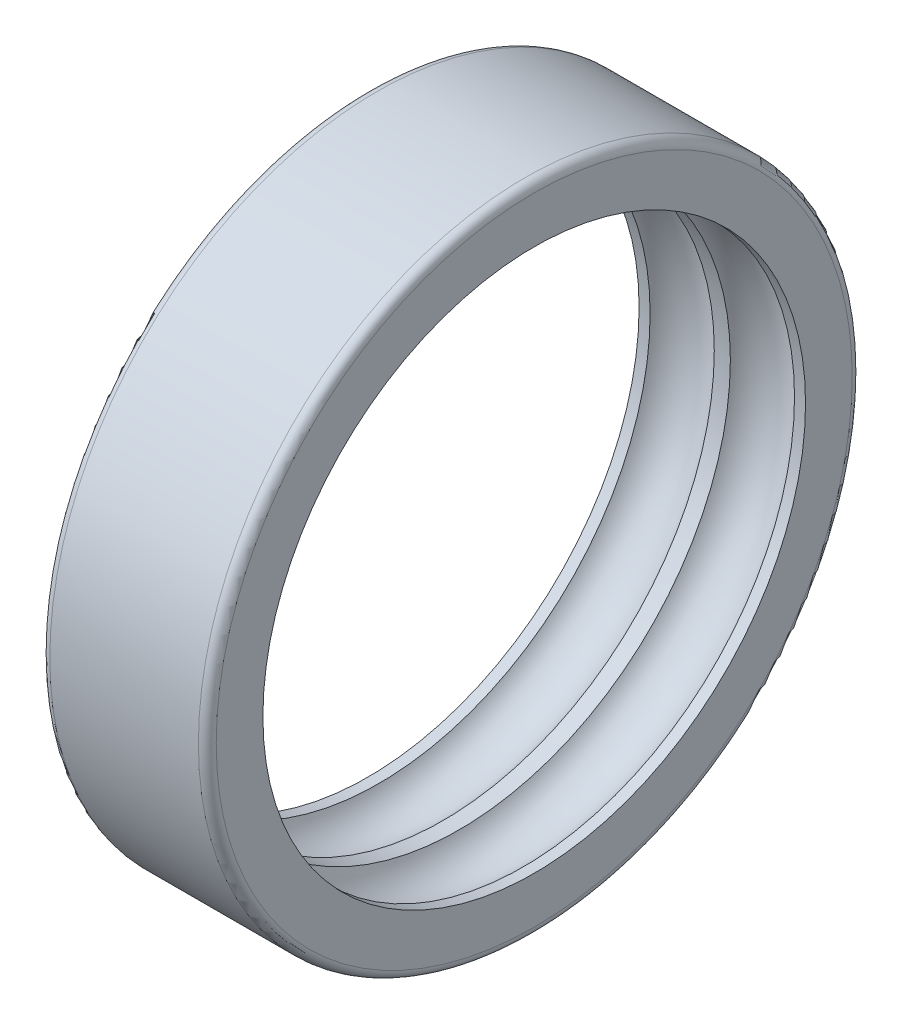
ISO-10303-21;
HEADER;
FILE_DESCRIPTION(('STEP AP214'),'2;1');
FILE_NAME('part.step','',(''),(''),'','','');
FILE_SCHEMA(('AUTOMOTIVE_DESIGN { 1 0 10303 214 1 1 1 1 }'));
ENDSEC;
DATA;
#1=APPLICATION_CONTEXT('core data for automotive mechanical design processes');
#2=APPLICATION_PROTOCOL_DEFINITION('international standard','automotive_design',2000,#1);
#3=PRODUCT_CONTEXT('',#1,'mechanical');
#4=PRODUCT('Part','Part','',(#3));
#5=PRODUCT_RELATED_PRODUCT_CATEGORY('part','',(#4));
#6=PRODUCT_DEFINITION_FORMATION('','',#4);
#7=PRODUCT_DEFINITION_CONTEXT('part definition',#1,'design');
#8=PRODUCT_DEFINITION('design','',#6,#7);
#9=PRODUCT_DEFINITION_SHAPE('','',#8);
#10=(LENGTH_UNIT() NAMED_UNIT(*) SI_UNIT(.MILLI.,.METRE.));
#11=(NAMED_UNIT(*) PLANE_ANGLE_UNIT() SI_UNIT($,.RADIAN.));
#12=(NAMED_UNIT(*) SI_UNIT($,.STERADIAN.) SOLID_ANGLE_UNIT());
#13=UNCERTAINTY_MEASURE_WITH_UNIT(LENGTH_MEASURE(1.E-05),#10,'distance_accuracy_value','');
#14=(GEOMETRIC_REPRESENTATION_CONTEXT(3) GLOBAL_UNCERTAINTY_ASSIGNED_CONTEXT((#13)) GLOBAL_UNIT_ASSIGNED_CONTEXT((#10,
#11,#12)) REPRESENTATION_CONTEXT('',''));
#15=CARTESIAN_POINT('',(0.,0.,0.));
#16=DIRECTION('',(0.,0.,1.));
#17=DIRECTION('',(1.,0.,0.));
#18=AXIS2_PLACEMENT_3D('',#15,#16,#17);
#19=CARTESIAN_POINT('',(1.5,0.,0.));
#20=DIRECTION('',(-1.,0.,0.));
#21=DIRECTION('',(0.,0.,1.));
#22=AXIS2_PLACEMENT_3D('',#19,#20,#21);
#23=TOROIDAL_SURFACE('',#22,53.5,1.5);
#24=CARTESIAN_POINT('',(0.,0.,0.));
#25=DIRECTION('',(-1.,0.,0.));
#26=DIRECTION('',(0.,0.,1.));
#27=AXIS2_PLACEMENT_3D('',#24,#25,#26);
#28=CIRCLE('',#27,53.5);
#29=CARTESIAN_POINT('',(0.,0.,53.5));
#30=VERTEX_POINT('',#29);
#31=EDGE_CURVE('E10',#30,#30,#28,.T.);
#32=ORIENTED_EDGE('',*,*,#31,.F.);
#33=EDGE_LOOP('',(#32));
#34=FACE_BOUND('',#33,.T.);
#35=CARTESIAN_POINT('',(1.5,0.,0.));
#36=DIRECTION('',(-1.,0.,0.));
#37=DIRECTION('',(0.,0.,1.));
#38=AXIS2_PLACEMENT_3D('',#35,#36,#37);
#39=CIRCLE('',#38,55.);
#40=CARTESIAN_POINT('',(1.5,0.,55.));
#41=VERTEX_POINT('',#40);
#42=EDGE_CURVE('E62',#41,#41,#39,.T.);
#43=ORIENTED_EDGE('',*,*,#42,.T.);
#44=EDGE_LOOP('',(#43));
#45=FACE_BOUND('',#44,.T.);
#46=ADVANCED_FACE('F28',(#34,#45),#23,.T.);
#47=CARTESIAN_POINT('',(0.,0.,-53.5));
#48=DIRECTION('',(1.,0.,0.));
#49=DIRECTION('',(0.,0.,-1.));
#50=AXIS2_PLACEMENT_3D('',#47,#48,#49);
#51=PLANE('',#50);
#52=CARTESIAN_POINT('',(0.,0.,0.));
#53=DIRECTION('',(-1.,0.,0.));
#54=DIRECTION('',(0.,0.,1.));
#55=AXIS2_PLACEMENT_3D('',#52,#53,#54);
#56=CIRCLE('',#55,45.65);
#57=CARTESIAN_POINT('',(0.,0.,45.65));
#58=VERTEX_POINT('',#57);
#59=EDGE_CURVE('E34',#58,#58,#56,.T.);
#60=ORIENTED_EDGE('',*,*,#59,.F.);
#61=EDGE_LOOP('',(#60));
#62=FACE_BOUND('',#61,.T.);
#63=ORIENTED_EDGE('',*,*,#31,.T.);
#64=EDGE_LOOP('',(#63));
#65=FACE_BOUND('',#64,.T.);
#66=ADVANCED_FACE('F111',(#62,#65),#51,.F.);
#67=CARTESIAN_POINT('',(0.,0.,0.));
#68=DIRECTION('',(-1.,0.,0.));
#69=DIRECTION('',(0.,0.,1.));
#70=AXIS2_PLACEMENT_3D('',#67,#68,#69);
#71=CYLINDRICAL_SURFACE('',#70,45.65);
#72=CARTESIAN_POINT('',(1.85185216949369,0.,0.));
#73=DIRECTION('',(-1.,0.,0.));
#74=DIRECTION('',(0.,0.,1.));
#75=AXIS2_PLACEMENT_3D('',#72,#73,#74);
#76=CIRCLE('',#75,45.65);
#77=CARTESIAN_POINT('',(1.85185216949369,0.,45.65));
#78=VERTEX_POINT('',#77);
#79=EDGE_CURVE('E38',#78,#78,#76,.T.);
#80=ORIENTED_EDGE('',*,*,#79,.F.);
#81=EDGE_LOOP('',(#80));
#82=FACE_BOUND('',#81,.T.);
#83=ORIENTED_EDGE('',*,*,#59,.T.);
#84=EDGE_LOOP('',(#83));
#85=FACE_BOUND('',#84,.T.);
#86=ADVANCED_FACE('F106',(#82,#85),#71,.F.);
#87=CARTESIAN_POINT('',(7.25,0.,0.));
#88=DIRECTION('',(-1.,0.,0.));
#89=DIRECTION('',(0.,0.,1.));
#90=AXIS2_PLACEMENT_3D('',#87,#88,#89);
#91=TOROIDAL_SURFACE('',#90,42.5,6.25);
#92=CARTESIAN_POINT('',(12.6481478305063,0.,0.));
#93=DIRECTION('',(-1.,0.,0.));
#94=DIRECTION('',(0.,0.,1.));
#95=AXIS2_PLACEMENT_3D('',#92,#93,#94);
#96=CIRCLE('',#95,45.65);
#97=CARTESIAN_POINT('',(12.6481478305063,0.,45.65));
#98=VERTEX_POINT('',#97);
#99=EDGE_CURVE('E42',#98,#98,#96,.T.);
#100=ORIENTED_EDGE('',*,*,#99,.F.);
#101=EDGE_LOOP('',(#100));
#102=FACE_BOUND('',#101,.T.);
#103=ORIENTED_EDGE('',*,*,#79,.T.);
#104=EDGE_LOOP('',(#103));
#105=FACE_BOUND('',#104,.T.);
#106=ADVANCED_FACE('F100',(#102,#105),#91,.F.);
#107=CARTESIAN_POINT('',(0.,0.,0.));
#108=DIRECTION('',(-1.,0.,0.));
#109=DIRECTION('',(0.,0.,1.));
#110=AXIS2_PLACEMENT_3D('',#107,#108,#109);
#111=CYLINDRICAL_SURFACE('',#110,45.65);
#112=CARTESIAN_POINT('',(15.3518521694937,0.,0.));
#113=DIRECTION('',(-1.,0.,0.));
#114=DIRECTION('',(0.,0.,1.));
#115=AXIS2_PLACEMENT_3D('',#112,#113,#114);
#116=CIRCLE('',#115,45.65);
#117=CARTESIAN_POINT('',(15.3518521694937,0.,45.65));
#118=VERTEX_POINT('',#117);
#119=EDGE_CURVE('E47',#118,#118,#116,.T.);
#120=ORIENTED_EDGE('',*,*,#119,.F.);
#121=EDGE_LOOP('',(#120));
#122=FACE_BOUND('',#121,.T.);
#123=ORIENTED_EDGE('',*,*,#99,.T.);
#124=EDGE_LOOP('',(#123));
#125=FACE_BOUND('',#124,.T.);
#126=ADVANCED_FACE('F94',(#122,#125),#111,.F.);
#127=CARTESIAN_POINT('',(20.75,0.,0.));
#128=DIRECTION('',(-1.,0.,0.));
#129=DIRECTION('',(0.,0.,1.));
#130=AXIS2_PLACEMENT_3D('',#127,#128,#129);
#131=TOROIDAL_SURFACE('',#130,42.5,6.25);
#132=CARTESIAN_POINT('',(26.1481478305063,0.,0.));
#133=DIRECTION('',(-1.,0.,0.));
#134=DIRECTION('',(0.,0.,1.));
#135=AXIS2_PLACEMENT_3D('',#132,#133,#134);
#136=CIRCLE('',#135,45.65);
#137=CARTESIAN_POINT('',(26.1481478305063,0.,45.65));
#138=VERTEX_POINT('',#137);
#139=EDGE_CURVE('E50',#138,#138,#136,.T.);
#140=ORIENTED_EDGE('',*,*,#139,.F.);
#141=EDGE_LOOP('',(#140));
#142=FACE_BOUND('',#141,.T.);
#143=ORIENTED_EDGE('',*,*,#119,.T.);
#144=EDGE_LOOP('',(#143));
#145=FACE_BOUND('',#144,.T.);
#146=ADVANCED_FACE('F88',(#142,#145),#131,.F.);
#147=CARTESIAN_POINT('',(0.,0.,0.));
#148=DIRECTION('',(-1.,0.,0.));
#149=DIRECTION('',(0.,0.,1.));
#150=AXIS2_PLACEMENT_3D('',#147,#148,#149);
#151=CYLINDRICAL_SURFACE('',#150,45.65);
#152=CARTESIAN_POINT('',(28.,0.,0.));
#153=DIRECTION('',(-1.,0.,0.));
#154=DIRECTION('',(0.,0.,1.));
#155=AXIS2_PLACEMENT_3D('',#152,#153,#154);
#156=CIRCLE('',#155,45.65);
#157=CARTESIAN_POINT('',(28.,0.,45.65));
#158=VERTEX_POINT('',#157);
#159=EDGE_CURVE('E53',#158,#158,#156,.T.);
#160=ORIENTED_EDGE('',*,*,#159,.F.);
#161=EDGE_LOOP('',(#160));
#162=FACE_BOUND('',#161,.T.);
#163=ORIENTED_EDGE('',*,*,#139,.T.);
#164=EDGE_LOOP('',(#163));
#165=FACE_BOUND('',#164,.T.);
#166=ADVANCED_FACE('F82',(#162,#165),#151,.F.);
#167=CARTESIAN_POINT('',(28.,0.,-53.5));
#168=DIRECTION('',(-1.,0.,0.));
#169=DIRECTION('',(0.,0.,1.));
#170=AXIS2_PLACEMENT_3D('',#167,#168,#169);
#171=PLANE('',#170);
#172=CARTESIAN_POINT('',(28.,0.,0.));
#173=DIRECTION('',(-1.,0.,0.));
#174=DIRECTION('',(0.,0.,1.));
#175=AXIS2_PLACEMENT_3D('',#172,#173,#174);
#176=CIRCLE('',#175,53.5);
#177=CARTESIAN_POINT('',(28.,0.,53.5));
#178=VERTEX_POINT('',#177);
#179=EDGE_CURVE('E56',#178,#178,#176,.T.);
#180=ORIENTED_EDGE('',*,*,#179,.F.);
#181=EDGE_LOOP('',(#180));
#182=FACE_BOUND('',#181,.T.);
#183=ORIENTED_EDGE('',*,*,#159,.T.);
#184=EDGE_LOOP('',(#183));
#185=FACE_BOUND('',#184,.T.);
#186=ADVANCED_FACE('F76',(#182,#185),#171,.F.);
#187=CARTESIAN_POINT('',(26.5,0.,0.));
#188=DIRECTION('',(-1.,0.,0.));
#189=DIRECTION('',(0.,0.,1.));
#190=AXIS2_PLACEMENT_3D('',#187,#188,#189);
#191=TOROIDAL_SURFACE('',#190,53.5,1.5);
#192=CARTESIAN_POINT('',(26.5,0.,0.));
#193=DIRECTION('',(-1.,0.,0.));
#194=DIRECTION('',(0.,0.,1.));
#195=AXIS2_PLACEMENT_3D('',#192,#193,#194);
#196=CIRCLE('',#195,55.);
#197=CARTESIAN_POINT('',(26.5,0.,55.));
#198=VERTEX_POINT('',#197);
#199=EDGE_CURVE('E59',#198,#198,#196,.T.);
#200=ORIENTED_EDGE('',*,*,#199,.F.);
#201=EDGE_LOOP('',(#200));
#202=FACE_BOUND('',#201,.T.);
#203=ORIENTED_EDGE('',*,*,#179,.T.);
#204=EDGE_LOOP('',(#203));
#205=FACE_BOUND('',#204,.T.);
#206=ADVANCED_FACE('F70',(#202,#205),#191,.T.);
#207=CARTESIAN_POINT('',(0.,0.,0.));
#208=DIRECTION('',(-1.,0.,0.));
#209=DIRECTION('',(0.,0.,1.));
#210=AXIS2_PLACEMENT_3D('',#207,#208,#209);
#211=CYLINDRICAL_SURFACE('',#210,55.);
#212=ORIENTED_EDGE('',*,*,#42,.F.);
#213=EDGE_LOOP('',(#212));
#214=FACE_BOUND('',#213,.T.);
#215=ORIENTED_EDGE('',*,*,#199,.T.);
#216=EDGE_LOOP('',(#215));
#217=FACE_BOUND('',#216,.T.);
#218=ADVANCED_FACE('F67',(#214,#217),#211,.T.);
#219=CLOSED_SHELL('',(#46,#66,#86,#106,#126,#146,#166,#186,#206,#218));
#220=MANIFOLD_SOLID_BREP('B2',#219);
#221=ADVANCED_BREP_SHAPE_REPRESENTATION('',(#18,#220),#14);
#222=SHAPE_DEFINITION_REPRESENTATION(#9,#221);
ENDSEC;
END-ISO-10303-21;
